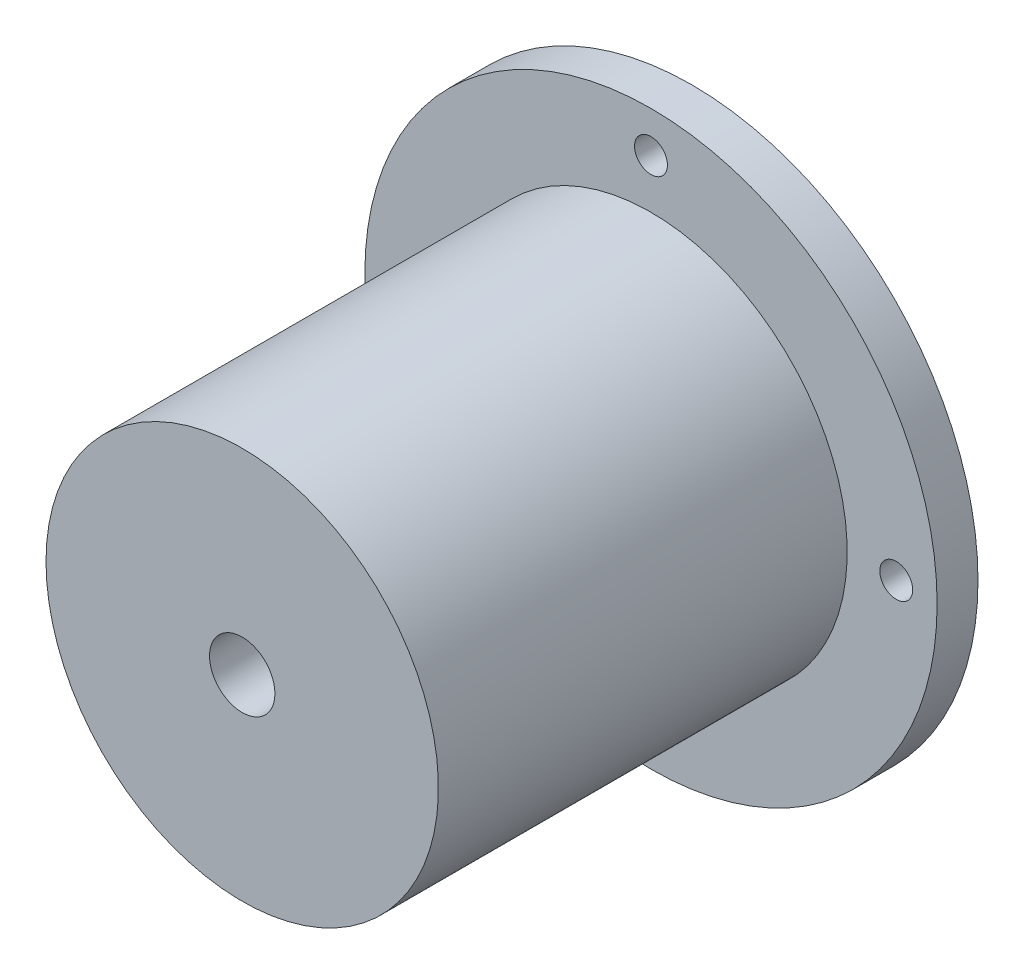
ISO-10303-21;
HEADER;
FILE_DESCRIPTION(('STEP AP214'),'2;1');
FILE_NAME('part.step','',(''),(''),'','','');
FILE_SCHEMA(('AUTOMOTIVE_DESIGN { 1 0 10303 214 1 1 1 1 }'));
ENDSEC;
DATA;
#1=APPLICATION_CONTEXT('core data for automotive mechanical design processes');
#2=APPLICATION_PROTOCOL_DEFINITION('international standard','automotive_design',2000,#1);
#3=PRODUCT_CONTEXT('',#1,'mechanical');
#4=PRODUCT('Part','Part','',(#3));
#5=PRODUCT_RELATED_PRODUCT_CATEGORY('part','',(#4));
#6=PRODUCT_DEFINITION_FORMATION('','',#4);
#7=PRODUCT_DEFINITION_CONTEXT('part definition',#1,'design');
#8=PRODUCT_DEFINITION('design','',#6,#7);
#9=PRODUCT_DEFINITION_SHAPE('','',#8);
#10=(LENGTH_UNIT() NAMED_UNIT(*) SI_UNIT(.MILLI.,.METRE.));
#11=(NAMED_UNIT(*) PLANE_ANGLE_UNIT() SI_UNIT($,.RADIAN.));
#12=(NAMED_UNIT(*) SI_UNIT($,.STERADIAN.) SOLID_ANGLE_UNIT());
#13=UNCERTAINTY_MEASURE_WITH_UNIT(LENGTH_MEASURE(1.E-05),#10,'distance_accuracy_value','');
#14=(GEOMETRIC_REPRESENTATION_CONTEXT(3) GLOBAL_UNCERTAINTY_ASSIGNED_CONTEXT((#13)) GLOBAL_UNIT_ASSIGNED_CONTEXT((#10,
#11,#12)) REPRESENTATION_CONTEXT('',''));
#15=CARTESIAN_POINT('',(0.,0.,0.));
#16=DIRECTION('',(0.,0.,1.));
#17=DIRECTION('',(1.,0.,0.));
#18=AXIS2_PLACEMENT_3D('',#15,#16,#17);
#19=CARTESIAN_POINT('',(0.,0.,0.));
#20=DIRECTION('',(0.,0.,1.));
#21=DIRECTION('',(1.,0.,0.));
#22=AXIS2_PLACEMENT_3D('',#19,#20,#21);
#23=PLANE('',#22);
#24=CARTESIAN_POINT('',(0.,0.,0.));
#25=DIRECTION('',(0.,0.,1.));
#26=DIRECTION('',(1.,0.,0.));
#27=AXIS2_PLACEMENT_3D('',#24,#25,#26);
#28=CIRCLE('',#27,5.08);
#29=CARTESIAN_POINT('',(5.08,0.,0.));
#30=VERTEX_POINT('',#29);
#31=EDGE_CURVE('E89',#30,#30,#28,.T.);
#32=ORIENTED_EDGE('',*,*,#31,.F.);
#33=EDGE_LOOP('',(#32));
#34=FACE_BOUND('',#33,.T.);
#35=CARTESIAN_POINT('',(0.,0.,0.));
#36=DIRECTION('',(0.,0.,-1.));
#37=DIRECTION('',(-1.,0.,0.));
#38=AXIS2_PLACEMENT_3D('',#35,#36,#37);
#39=CIRCLE('',#38,30.48);
#40=CARTESIAN_POINT('',(-30.48,0.,0.));
#41=VERTEX_POINT('',#40);
#42=EDGE_CURVE('E10',#41,#41,#39,.T.);
#43=ORIENTED_EDGE('',*,*,#42,.F.);
#44=EDGE_LOOP('',(#43));
#45=FACE_BOUND('',#44,.T.);
#46=ADVANCED_FACE('F34',(#34,#45),#23,.T.);
#47=CARTESIAN_POINT('',(0.,0.,-7.62000000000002));
#48=DIRECTION('',(0.,0.,-1.));
#49=DIRECTION('',(-1.,0.,0.));
#50=AXIS2_PLACEMENT_3D('',#47,#48,#49);
#51=CYLINDRICAL_SURFACE('',#50,30.48);
#52=ORIENTED_EDGE('',*,*,#42,.T.);
#53=EDGE_LOOP('',(#52));
#54=FACE_BOUND('',#53,.T.);
#55=CARTESIAN_POINT('',(0.,1.38777878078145E-13,-63.5));
#56=DIRECTION('',(0.,0.,-1.));
#57=DIRECTION('',(-1.,0.,0.));
#58=AXIS2_PLACEMENT_3D('',#55,#56,#57);
#59=CIRCLE('',#58,30.48);
#60=CARTESIAN_POINT('',(-30.48,1.38777878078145E-13,-63.5));
#61=VERTEX_POINT('',#60);
#62=EDGE_CURVE('E41',#61,#61,#59,.T.);
#63=ORIENTED_EDGE('',*,*,#62,.F.);
#64=EDGE_LOOP('',(#63));
#65=FACE_BOUND('',#64,.T.);
#66=ADVANCED_FACE('F117',(#54,#65),#51,.T.);
#67=CARTESIAN_POINT('',(-30.48,1.38777878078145E-13,-63.5));
#68=DIRECTION('',(0.,0.,1.));
#69=DIRECTION('',(1.,0.,0.));
#70=AXIS2_PLACEMENT_3D('',#67,#68,#69);
#71=PLANE('',#70);
#72=CARTESIAN_POINT('',(-38.1,5.41233724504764E-13,-63.5));
#73=DIRECTION('',(0.,0.,1.));
#74=DIRECTION('',(1.,0.,0.));
#75=AXIS2_PLACEMENT_3D('',#72,#73,#74);
#76=CIRCLE('',#75,2.5527);
#77=CARTESIAN_POINT('',(-35.5473,5.41233724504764E-13,-63.5));
#78=VERTEX_POINT('',#77);
#79=EDGE_CURVE('E83',#78,#78,#76,.T.);
#80=ORIENTED_EDGE('',*,*,#79,.F.);
#81=EDGE_LOOP('',(#80));
#82=FACE_BOUND('',#81,.T.);
#83=CARTESIAN_POINT('',(-2.68091811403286E-13,-38.0999999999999,-63.4999999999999));
#84=DIRECTION('',(0.,0.,1.));
#85=DIRECTION('',(1.,0.,0.));
#86=AXIS2_PLACEMENT_3D('',#83,#84,#85);
#87=CIRCLE('',#86,2.5527);
#88=CARTESIAN_POINT('',(2.55269999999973,-38.0999999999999,-63.4999999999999));
#89=VERTEX_POINT('',#88);
#90=EDGE_CURVE('E77',#89,#89,#87,.T.);
#91=ORIENTED_EDGE('',*,*,#90,.F.);
#92=EDGE_LOOP('',(#91));
#93=FACE_BOUND('',#92,.T.);
#94=CARTESIAN_POINT('',(38.1,0.,-63.5));
#95=DIRECTION('',(0.,0.,1.));
#96=DIRECTION('',(1.,0.,0.));
#97=AXIS2_PLACEMENT_3D('',#94,#95,#96);
#98=CIRCLE('',#97,2.5527);
#99=CARTESIAN_POINT('',(40.6527,0.,-63.5));
#100=VERTEX_POINT('',#99);
#101=EDGE_CURVE('E71',#100,#100,#98,.T.);
#102=ORIENTED_EDGE('',*,*,#101,.F.);
#103=EDGE_LOOP('',(#102));
#104=FACE_BOUND('',#103,.T.);
#105=CARTESIAN_POINT('',(0.,38.1000000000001,-63.5000000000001));
#106=DIRECTION('',(0.,0.,1.));
#107=DIRECTION('',(1.,0.,0.));
#108=AXIS2_PLACEMENT_3D('',#105,#106,#107);
#109=CIRCLE('',#108,2.5527);
#110=CARTESIAN_POINT('',(2.5527,38.1000000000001,-63.5000000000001));
#111=VERTEX_POINT('',#110);
#112=EDGE_CURVE('E65',#111,#111,#109,.T.);
#113=ORIENTED_EDGE('',*,*,#112,.F.);
#114=EDGE_LOOP('',(#113));
#115=FACE_BOUND('',#114,.T.);
#116=ORIENTED_EDGE('',*,*,#62,.T.);
#117=EDGE_LOOP('',(#116));
#118=FACE_BOUND('',#117,.T.);
#119=CARTESIAN_POINT('',(0.,1.38777878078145E-13,-63.5));
#120=DIRECTION('',(0.,0.,-1.));
#121=DIRECTION('',(-1.,0.,0.));
#122=AXIS2_PLACEMENT_3D('',#119,#120,#121);
#123=CIRCLE('',#122,44.45);
#124=CARTESIAN_POINT('',(-44.45,1.38777878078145E-13,-63.5));
#125=VERTEX_POINT('',#124);
#126=EDGE_CURVE('E45',#125,#125,#123,.T.);
#127=ORIENTED_EDGE('',*,*,#126,.F.);
#128=EDGE_LOOP('',(#127));
#129=FACE_BOUND('',#128,.T.);
#130=ADVANCED_FACE('F122',(#82,#93,#104,#115,#118,#129),#71,.T.);
#131=CARTESIAN_POINT('',(0.,0.,-7.62000000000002));
#132=DIRECTION('',(0.,0.,-1.));
#133=DIRECTION('',(-1.,0.,0.));
#134=AXIS2_PLACEMENT_3D('',#131,#132,#133);
#135=CYLINDRICAL_SURFACE('',#134,44.45);
#136=ORIENTED_EDGE('',*,*,#126,.T.);
#137=EDGE_LOOP('',(#136));
#138=FACE_BOUND('',#137,.T.);
#139=CARTESIAN_POINT('',(0.,1.38777878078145E-13,-69.85));
#140=DIRECTION('',(0.,0.,-1.));
#141=DIRECTION('',(-1.,0.,0.));
#142=AXIS2_PLACEMENT_3D('',#139,#140,#141);
#143=CIRCLE('',#142,44.45);
#144=CARTESIAN_POINT('',(-44.45,1.38777878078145E-13,-69.85));
#145=VERTEX_POINT('',#144);
#146=EDGE_CURVE('E50',#145,#145,#143,.T.);
#147=ORIENTED_EDGE('',*,*,#146,.F.);
#148=EDGE_LOOP('',(#147));
#149=FACE_BOUND('',#148,.T.);
#150=ADVANCED_FACE('F127',(#138,#149),#135,.T.);
#151=CARTESIAN_POINT('',(-44.45,1.38777878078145E-13,-69.8500000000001));
#152=DIRECTION('',(0.,0.,-1.));
#153=DIRECTION('',(-1.,0.,0.));
#154=AXIS2_PLACEMENT_3D('',#151,#152,#153);
#155=PLANE('',#154);
#156=CARTESIAN_POINT('',(-38.1,5.41233724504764E-13,-69.85));
#157=DIRECTION('',(0.,0.,-1.));
#158=DIRECTION('',(0.,-1.,0.));
#159=AXIS2_PLACEMENT_3D('',#156,#157,#158);
#160=CIRCLE('',#159,2.5527);
#161=CARTESIAN_POINT('',(-38.1000000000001,-2.55269999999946,-69.85));
#162=VERTEX_POINT('',#161);
#163=EDGE_CURVE('E86',#162,#162,#160,.T.);
#164=ORIENTED_EDGE('',*,*,#163,.F.);
#165=EDGE_LOOP('',(#164));
#166=FACE_BOUND('',#165,.T.);
#167=CARTESIAN_POINT('',(-2.68188991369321E-13,-38.0999999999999,-69.8499999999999));
#168=DIRECTION('',(0.,0.,-1.));
#169=DIRECTION('',(1.,0.,0.));
#170=AXIS2_PLACEMENT_3D('',#167,#168,#169);
#171=CIRCLE('',#170,2.5527);
#172=CARTESIAN_POINT('',(2.55269999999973,-38.0999999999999,-69.8499999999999));
#173=VERTEX_POINT('',#172);
#174=EDGE_CURVE('E80',#173,#173,#171,.T.);
#175=ORIENTED_EDGE('',*,*,#174,.F.);
#176=EDGE_LOOP('',(#175));
#177=FACE_BOUND('',#176,.T.);
#178=CARTESIAN_POINT('',(38.1,0.,-69.85));
#179=DIRECTION('',(0.,0.,-1.));
#180=DIRECTION('',(0.,1.,0.));
#181=AXIS2_PLACEMENT_3D('',#178,#179,#180);
#182=CIRCLE('',#181,2.5527);
#183=CARTESIAN_POINT('',(38.1,2.55270000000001,-69.85));
#184=VERTEX_POINT('',#183);
#185=EDGE_CURVE('E74',#184,#184,#182,.T.);
#186=ORIENTED_EDGE('',*,*,#185,.F.);
#187=EDGE_LOOP('',(#186));
#188=FACE_BOUND('',#187,.T.);
#189=CARTESIAN_POINT('',(0.,38.1000000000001,-69.8500000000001));
#190=DIRECTION('',(0.,0.,-1.));
#191=DIRECTION('',(-1.,0.,0.));
#192=AXIS2_PLACEMENT_3D('',#189,#190,#191);
#193=CIRCLE('',#192,2.5527);
#194=CARTESIAN_POINT('',(-2.5527,38.1000000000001,-69.8500000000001));
#195=VERTEX_POINT('',#194);
#196=EDGE_CURVE('E68',#195,#195,#193,.T.);
#197=ORIENTED_EDGE('',*,*,#196,.F.);
#198=EDGE_LOOP('',(#197));
#199=FACE_BOUND('',#198,.T.);
#200=ORIENTED_EDGE('',*,*,#146,.T.);
#201=EDGE_LOOP('',(#200));
#202=FACE_BOUND('',#201,.T.);
#203=CARTESIAN_POINT('',(0.,1.38777878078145E-13,-69.85));
#204=DIRECTION('',(0.,0.,-1.));
#205=DIRECTION('',(-1.,0.,0.));
#206=AXIS2_PLACEMENT_3D('',#203,#204,#205);
#207=CIRCLE('',#206,22.86);
#208=CARTESIAN_POINT('',(-22.86,1.38777878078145E-13,-69.85));
#209=VERTEX_POINT('',#208);
#210=EDGE_CURVE('E53',#209,#209,#207,.T.);
#211=ORIENTED_EDGE('',*,*,#210,.F.);
#212=EDGE_LOOP('',(#211));
#213=FACE_BOUND('',#212,.T.);
#214=ADVANCED_FACE('F134',(#166,#177,#188,#199,#202,#213),#155,.T.);
#215=CARTESIAN_POINT('',(0.,0.,-7.62000000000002));
#216=DIRECTION('',(0.,0.,-1.));
#217=DIRECTION('',(-1.,0.,0.));
#218=AXIS2_PLACEMENT_3D('',#215,#216,#217);
#219=CYLINDRICAL_SURFACE('',#218,22.86);
#220=ORIENTED_EDGE('',*,*,#210,.T.);
#221=EDGE_LOOP('',(#220));
#222=FACE_BOUND('',#221,.T.);
#223=CARTESIAN_POINT('',(0.,0.,-12.7));
#224=DIRECTION('',(0.,0.,-1.));
#225=DIRECTION('',(-1.,0.,0.));
#226=AXIS2_PLACEMENT_3D('',#223,#224,#225);
#227=CIRCLE('',#226,22.86);
#228=CARTESIAN_POINT('',(-22.86,0.,-12.7));
#229=VERTEX_POINT('',#228);
#230=EDGE_CURVE('E56',#229,#229,#227,.T.);
#231=ORIENTED_EDGE('',*,*,#230,.F.);
#232=EDGE_LOOP('',(#231));
#233=FACE_BOUND('',#232,.T.);
#234=ADVANCED_FACE('F113',(#222,#233),#219,.F.);
#235=CARTESIAN_POINT('',(-22.86,0.,-12.7));
#236=DIRECTION('',(0.,0.,-1.));
#237=DIRECTION('',(-1.,0.,0.));
#238=AXIS2_PLACEMENT_3D('',#235,#236,#237);
#239=PLANE('',#238);
#240=ORIENTED_EDGE('',*,*,#230,.T.);
#241=EDGE_LOOP('',(#240));
#242=FACE_BOUND('',#241,.T.);
#243=CARTESIAN_POINT('',(0.,0.,-12.7));
#244=DIRECTION('',(0.,0.,-1.));
#245=DIRECTION('',(-1.,0.,0.));
#246=AXIS2_PLACEMENT_3D('',#243,#244,#245);
#247=CIRCLE('',#246,17.5006);
#248=CARTESIAN_POINT('',(-17.5006,0.,-12.7));
#249=VERTEX_POINT('',#248);
#250=EDGE_CURVE('E59',#249,#249,#247,.T.);
#251=ORIENTED_EDGE('',*,*,#250,.F.);
#252=EDGE_LOOP('',(#251));
#253=FACE_BOUND('',#252,.T.);
#254=ADVANCED_FACE('F107',(#242,#253),#239,.T.);
#255=CARTESIAN_POINT('',(0.,0.,-7.62000000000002));
#256=DIRECTION('',(0.,0.,-1.));
#257=DIRECTION('',(-1.,0.,0.));
#258=AXIS2_PLACEMENT_3D('',#255,#256,#257);
#259=CYLINDRICAL_SURFACE('',#258,17.5006);
#260=ORIENTED_EDGE('',*,*,#250,.T.);
#261=EDGE_LOOP('',(#260));
#262=FACE_BOUND('',#261,.T.);
#263=CARTESIAN_POINT('',(0.,0.,-7.62000000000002));
#264=DIRECTION('',(0.,0.,-1.));
#265=DIRECTION('',(-1.,0.,0.));
#266=AXIS2_PLACEMENT_3D('',#263,#264,#265);
#267=CIRCLE('',#266,17.5006);
#268=CARTESIAN_POINT('',(-17.5006,0.,-7.62000000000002));
#269=VERTEX_POINT('',#268);
#270=EDGE_CURVE('E62',#269,#269,#267,.T.);
#271=ORIENTED_EDGE('',*,*,#270,.F.);
#272=EDGE_LOOP('',(#271));
#273=FACE_BOUND('',#272,.T.);
#274=ADVANCED_FACE('F102',(#262,#273),#259,.F.);
#275=CARTESIAN_POINT('',(-17.5006,0.,-7.62000000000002));
#276=DIRECTION('',(0.,0.,-1.));
#277=DIRECTION('',(-1.,0.,0.));
#278=AXIS2_PLACEMENT_3D('',#275,#276,#277);
#279=PLANE('',#278);
#280=CARTESIAN_POINT('',(0.,0.,-7.62000000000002));
#281=DIRECTION('',(0.,0.,-1.));
#282=DIRECTION('',(-1.,0.,0.));
#283=AXIS2_PLACEMENT_3D('',#280,#281,#282);
#284=CIRCLE('',#283,5.08);
#285=CARTESIAN_POINT('',(-5.08,0.,-7.62000000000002));
#286=VERTEX_POINT('',#285);
#287=EDGE_CURVE('E37',#286,#286,#284,.T.);
#288=ORIENTED_EDGE('',*,*,#287,.F.);
#289=EDGE_LOOP('',(#288));
#290=FACE_BOUND('',#289,.T.);
#291=ORIENTED_EDGE('',*,*,#270,.T.);
#292=EDGE_LOOP('',(#291));
#293=FACE_BOUND('',#292,.T.);
#294=ADVANCED_FACE('F98',(#290,#293),#279,.T.);
#295=CARTESIAN_POINT('',(0.,38.1,0.));
#296=DIRECTION('',(0.,0.,-1.));
#297=DIRECTION('',(-1.,0.,0.));
#298=AXIS2_PLACEMENT_3D('',#295,#296,#297);
#299=CYLINDRICAL_SURFACE('',#298,2.5527);
#300=ORIENTED_EDGE('',*,*,#112,.T.);
#301=EDGE_LOOP('',(#300));
#302=FACE_BOUND('',#301,.T.);
#303=ORIENTED_EDGE('',*,*,#196,.T.);
#304=EDGE_LOOP('',(#303));
#305=FACE_BOUND('',#304,.T.);
#306=ADVANCED_FACE('F101',(#302,#305),#299,.F.);
#307=CARTESIAN_POINT('',(38.1,-1.31838984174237E-13,0.));
#308=DIRECTION('',(0.,0.,-1.));
#309=DIRECTION('',(-1.,0.,0.));
#310=AXIS2_PLACEMENT_3D('',#307,#308,#309);
#311=CYLINDRICAL_SURFACE('',#310,2.5527);
#312=ORIENTED_EDGE('',*,*,#101,.T.);
#313=EDGE_LOOP('',(#312));
#314=FACE_BOUND('',#313,.T.);
#315=ORIENTED_EDGE('',*,*,#185,.T.);
#316=EDGE_LOOP('',(#315));
#317=FACE_BOUND('',#316,.T.);
#318=ADVANCED_FACE('F174',(#314,#317),#311,.F.);
#319=CARTESIAN_POINT('',(-2.67120011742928E-13,-38.1,0.));
#320=DIRECTION('',(0.,0.,-1.));
#321=DIRECTION('',(-1.,0.,0.));
#322=AXIS2_PLACEMENT_3D('',#319,#320,#321);
#323=CYLINDRICAL_SURFACE('',#322,2.5527);
#324=ORIENTED_EDGE('',*,*,#90,.T.);
#325=EDGE_LOOP('',(#324));
#326=FACE_BOUND('',#325,.T.);
#327=ORIENTED_EDGE('',*,*,#174,.T.);
#328=EDGE_LOOP('',(#327));
#329=FACE_BOUND('',#328,.T.);
#330=ADVANCED_FACE('F184',(#326,#329),#323,.F.);
#331=CARTESIAN_POINT('',(-38.1,4.02455846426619E-13,0.));
#332=DIRECTION('',(0.,0.,-1.));
#333=DIRECTION('',(-1.,0.,0.));
#334=AXIS2_PLACEMENT_3D('',#331,#332,#333);
#335=CYLINDRICAL_SURFACE('',#334,2.5527);
#336=ORIENTED_EDGE('',*,*,#79,.T.);
#337=EDGE_LOOP('',(#336));
#338=FACE_BOUND('',#337,.T.);
#339=ORIENTED_EDGE('',*,*,#163,.T.);
#340=EDGE_LOOP('',(#339));
#341=FACE_BOUND('',#340,.T.);
#342=ADVANCED_FACE('F194',(#338,#341),#335,.F.);
#343=CARTESIAN_POINT('',(0.,1.38777878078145E-13,-69.85));
#344=DIRECTION('',(0.,0.,1.));
#345=DIRECTION('',(1.,0.,0.));
#346=AXIS2_PLACEMENT_3D('',#343,#344,#345);
#347=CYLINDRICAL_SURFACE('',#346,5.08);
#348=ORIENTED_EDGE('',*,*,#287,.T.);
#349=EDGE_LOOP('',(#348));
#350=FACE_BOUND('',#349,.T.);
#351=ORIENTED_EDGE('',*,*,#31,.T.);
#352=EDGE_LOOP('',(#351));
#353=FACE_BOUND('',#352,.T.);
#354=ADVANCED_FACE('F96',(#350,#353),#347,.F.);
#355=CLOSED_SHELL('',(#46,#66,#130,#150,#214,#234,#254,#274,#294,#306,#318,#330,#342,#354));
#356=MANIFOLD_SOLID_BREP('B2',#355);
#357=ADVANCED_BREP_SHAPE_REPRESENTATION('',(#18,#356),#14);
#358=SHAPE_DEFINITION_REPRESENTATION(#9,#357);
ENDSEC;
END-ISO-10303-21;
